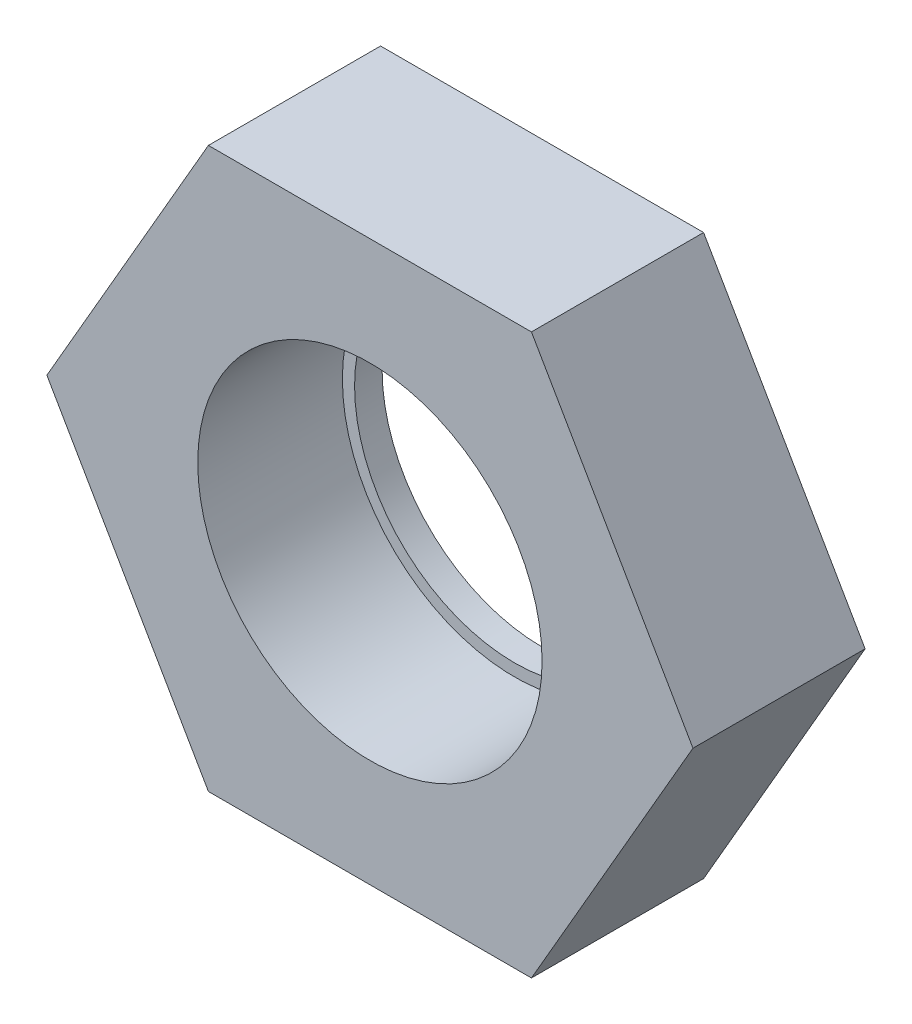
ISO-10303-21;
HEADER;
FILE_DESCRIPTION(('STEP AP214'),'2;1');
FILE_NAME('part.step','',(''),(''),'','','');
FILE_SCHEMA(('AUTOMOTIVE_DESIGN { 1 0 10303 214 1 1 1 1 }'));
ENDSEC;
DATA;
#1=APPLICATION_CONTEXT('core data for automotive mechanical design processes');
#2=APPLICATION_PROTOCOL_DEFINITION('international standard','automotive_design',2000,#1);
#3=PRODUCT_CONTEXT('',#1,'mechanical');
#4=PRODUCT('Part','Part','',(#3));
#5=PRODUCT_RELATED_PRODUCT_CATEGORY('part','',(#4));
#6=PRODUCT_DEFINITION_FORMATION('','',#4);
#7=PRODUCT_DEFINITION_CONTEXT('part definition',#1,'design');
#8=PRODUCT_DEFINITION('design','',#6,#7);
#9=PRODUCT_DEFINITION_SHAPE('','',#8);
#10=(LENGTH_UNIT() NAMED_UNIT(*) SI_UNIT(.MILLI.,.METRE.));
#11=(NAMED_UNIT(*) PLANE_ANGLE_UNIT() SI_UNIT($,.RADIAN.));
#12=(NAMED_UNIT(*) SI_UNIT($,.STERADIAN.) SOLID_ANGLE_UNIT());
#13=UNCERTAINTY_MEASURE_WITH_UNIT(LENGTH_MEASURE(1.E-05),#10,'distance_accuracy_value','');
#14=(GEOMETRIC_REPRESENTATION_CONTEXT(3) GLOBAL_UNCERTAINTY_ASSIGNED_CONTEXT((#13)) GLOBAL_UNIT_ASSIGNED_CONTEXT((#10,
#11,#12)) REPRESENTATION_CONTEXT('',''));
#15=CARTESIAN_POINT('',(0.,0.,0.));
#16=DIRECTION('',(0.,0.,1.));
#17=DIRECTION('',(1.,0.,0.));
#18=AXIS2_PLACEMENT_3D('',#15,#16,#17);
#19=CARTESIAN_POINT('',(17.8725992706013,10.31875,6.35));
#20=DIRECTION('',(0.,0.,1.));
#21=DIRECTION('',(1.,0.,0.));
#22=AXIS2_PLACEMENT_3D('',#19,#20,#21);
#23=PLANE('',#22);
#24=DIRECTION('',(0.5,0.866025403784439,0.));
#25=VECTOR('',#24,1.);
#26=CARTESIAN_POINT('',(5.95753309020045,-10.31875,6.35));
#27=LINE('',#26,#25);
#28=CARTESIAN_POINT('',(5.95753309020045,-10.31875,6.35));
#29=VERTEX_POINT('',#28);
#30=CARTESIAN_POINT('',(11.9150661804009,0.,6.35));
#31=VERTEX_POINT('',#30);
#32=EDGE_CURVE('E100',#29,#31,#27,.T.);
#33=ORIENTED_EDGE('',*,*,#32,.T.);
#34=DIRECTION('',(-0.5,0.866025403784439,0.));
#35=VECTOR('',#34,1.);
#36=CARTESIAN_POINT('',(11.9150661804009,0.,6.35));
#37=LINE('',#36,#35);
#38=CARTESIAN_POINT('',(5.95753309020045,10.31875,6.35));
#39=VERTEX_POINT('',#38);
#40=EDGE_CURVE('E82',#31,#39,#37,.T.);
#41=ORIENTED_EDGE('',*,*,#40,.T.);
#42=DIRECTION('',(-1.,0.,0.));
#43=VECTOR('',#42,1.);
#44=CARTESIAN_POINT('',(5.95753309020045,10.31875,6.35));
#45=LINE('',#44,#43);
#46=CARTESIAN_POINT('',(-5.95753309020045,10.31875,6.35));
#47=VERTEX_POINT('',#46);
#48=EDGE_CURVE('E103',#39,#47,#45,.T.);
#49=ORIENTED_EDGE('',*,*,#48,.T.);
#50=DIRECTION('',(-0.5,-0.866025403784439,0.));
#51=VECTOR('',#50,1.);
#52=CARTESIAN_POINT('',(-5.95753309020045,10.31875,6.35));
#53=LINE('',#52,#51);
#54=CARTESIAN_POINT('',(-11.9150661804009,0.,6.35));
#55=VERTEX_POINT('',#54);
#56=EDGE_CURVE('E105',#47,#55,#53,.T.);
#57=ORIENTED_EDGE('',*,*,#56,.T.);
#58=DIRECTION('',(0.5,-0.866025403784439,0.));
#59=VECTOR('',#58,1.);
#60=CARTESIAN_POINT('',(-11.9150661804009,0.,6.35));
#61=LINE('',#60,#59);
#62=CARTESIAN_POINT('',(-5.95753309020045,-10.31875,6.35));
#63=VERTEX_POINT('',#62);
#64=EDGE_CURVE('E35',#55,#63,#61,.T.);
#65=ORIENTED_EDGE('',*,*,#64,.T.);
#66=DIRECTION('',(1.,0.,0.));
#67=VECTOR('',#66,1.);
#68=CARTESIAN_POINT('',(-5.95753309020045,-10.31875,6.35));
#69=LINE('',#68,#67);
#70=EDGE_CURVE('E30',#63,#29,#69,.T.);
#71=ORIENTED_EDGE('',*,*,#70,.T.);
#72=EDGE_LOOP('',(#33,#41,#49,#57,#65,#71));
#73=FACE_BOUND('',#72,.T.);
#74=CARTESIAN_POINT('',(0.,0.,6.35));
#75=DIRECTION('',(0.,0.,1.));
#76=DIRECTION('',(1.,0.,0.));
#77=AXIS2_PLACEMENT_3D('',#74,#75,#76);
#78=CIRCLE('',#77,6.35);
#79=CARTESIAN_POINT('',(6.35,0.,6.35));
#80=VERTEX_POINT('',#79);
#81=EDGE_CURVE('E18',#80,#80,#78,.F.);
#82=ORIENTED_EDGE('',*,*,#81,.T.);
#83=EDGE_LOOP('',(#82));
#84=FACE_BOUND('',#83,.T.);
#85=ADVANCED_FACE('F14',(#73,#84),#23,.T.);
#86=CARTESIAN_POINT('',(17.8725992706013,10.31875,0.));
#87=DIRECTION('',(0.,0.,1.));
#88=DIRECTION('',(1.,0.,0.));
#89=AXIS2_PLACEMENT_3D('',#86,#87,#88);
#90=PLANE('',#89);
#91=DIRECTION('',(0.5,0.866025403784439,0.));
#92=VECTOR('',#91,1.);
#93=CARTESIAN_POINT('',(5.95753309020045,-10.31875,0.));
#94=LINE('',#93,#92);
#95=CARTESIAN_POINT('',(5.95753309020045,-10.31875,0.));
#96=VERTEX_POINT('',#95);
#97=CARTESIAN_POINT('',(11.9150661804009,0.,0.));
#98=VERTEX_POINT('',#97);
#99=EDGE_CURVE('E73',#96,#98,#94,.T.);
#100=ORIENTED_EDGE('',*,*,#99,.F.);
#101=DIRECTION('',(1.,0.,0.));
#102=VECTOR('',#101,1.);
#103=CARTESIAN_POINT('',(-5.95753309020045,-10.31875,0.));
#104=LINE('',#103,#102);
#105=CARTESIAN_POINT('',(-5.95753309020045,-10.31875,0.));
#106=VERTEX_POINT('',#105);
#107=EDGE_CURVE('E98',#106,#96,#104,.T.);
#108=ORIENTED_EDGE('',*,*,#107,.F.);
#109=DIRECTION('',(0.5,-0.866025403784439,0.));
#110=VECTOR('',#109,1.);
#111=CARTESIAN_POINT('',(-11.9150661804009,0.,0.));
#112=LINE('',#111,#110);
#113=CARTESIAN_POINT('',(-11.9150661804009,0.,0.));
#114=VERTEX_POINT('',#113);
#115=EDGE_CURVE('E96',#114,#106,#112,.T.);
#116=ORIENTED_EDGE('',*,*,#115,.F.);
#117=DIRECTION('',(-0.5,-0.866025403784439,0.));
#118=VECTOR('',#117,1.);
#119=CARTESIAN_POINT('',(-5.95753309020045,10.31875,0.));
#120=LINE('',#119,#118);
#121=CARTESIAN_POINT('',(-5.95753309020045,10.31875,0.));
#122=VERTEX_POINT('',#121);
#123=EDGE_CURVE('E94',#122,#114,#120,.T.);
#124=ORIENTED_EDGE('',*,*,#123,.F.);
#125=DIRECTION('',(-1.,0.,0.));
#126=VECTOR('',#125,1.);
#127=CARTESIAN_POINT('',(5.95753309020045,10.31875,0.));
#128=LINE('',#127,#126);
#129=CARTESIAN_POINT('',(5.95753309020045,10.31875,0.));
#130=VERTEX_POINT('',#129);
#131=EDGE_CURVE('E75',#130,#122,#128,.T.);
#132=ORIENTED_EDGE('',*,*,#131,.F.);
#133=DIRECTION('',(-0.5,0.866025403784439,0.));
#134=VECTOR('',#133,1.);
#135=CARTESIAN_POINT('',(11.9150661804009,0.,0.));
#136=LINE('',#135,#134);
#137=EDGE_CURVE('E68',#98,#130,#136,.T.);
#138=ORIENTED_EDGE('',*,*,#137,.F.);
#139=EDGE_LOOP('',(#100,#108,#116,#124,#132,#138));
#140=FACE_BOUND('',#139,.T.);
#141=CARTESIAN_POINT('',(0.,0.,0.));
#142=DIRECTION('',(0.,0.,1.));
#143=DIRECTION('',(1.,0.,0.));
#144=AXIS2_PLACEMENT_3D('',#141,#142,#143);
#145=CIRCLE('',#144,5.9);
#146=CARTESIAN_POINT('',(5.9,0.,0.));
#147=VERTEX_POINT('',#146);
#148=EDGE_CURVE('E166',#147,#147,#145,.F.);
#149=ORIENTED_EDGE('',*,*,#148,.F.);
#150=EDGE_LOOP('',(#149));
#151=FACE_BOUND('',#150,.T.);
#152=ADVANCED_FACE('F69',(#140,#151),#90,.F.);
#153=CARTESIAN_POINT('',(5.95753309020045,-10.31875,6.35));
#154=DIRECTION('',(-0.866025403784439,0.5,0.));
#155=DIRECTION('',(-0.5,-0.866025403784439,0.));
#156=AXIS2_PLACEMENT_3D('',#153,#154,#155);
#157=PLANE('',#156);
#158=ORIENTED_EDGE('',*,*,#99,.T.);
#159=DIRECTION('',(0.,0.,-1.));
#160=VECTOR('',#159,1.);
#161=CARTESIAN_POINT('',(11.9150661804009,0.,6.35));
#162=LINE('',#161,#160);
#163=EDGE_CURVE('E9',#31,#98,#162,.T.);
#164=ORIENTED_EDGE('',*,*,#163,.F.);
#165=ORIENTED_EDGE('',*,*,#32,.F.);
#166=DIRECTION('',(0.,0.,-1.));
#167=VECTOR('',#166,1.);
#168=CARTESIAN_POINT('',(5.95753309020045,-10.31875,6.35));
#169=LINE('',#168,#167);
#170=EDGE_CURVE('E86',#29,#96,#169,.T.);
#171=ORIENTED_EDGE('',*,*,#170,.T.);
#172=EDGE_LOOP('',(#158,#164,#165,#171));
#173=FACE_BOUND('',#172,.T.);
#174=ADVANCED_FACE('F16',(#173),#157,.F.);
#175=CARTESIAN_POINT('',(11.9150661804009,0.,6.35));
#176=DIRECTION('',(-0.866025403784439,-0.5,0.));
#177=DIRECTION('',(0.5,-0.866025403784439,0.));
#178=AXIS2_PLACEMENT_3D('',#175,#176,#177);
#179=PLANE('',#178);
#180=ORIENTED_EDGE('',*,*,#137,.T.);
#181=DIRECTION('',(0.,0.,-1.));
#182=VECTOR('',#181,1.);
#183=CARTESIAN_POINT('',(5.95753309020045,10.31875,6.35));
#184=LINE('',#183,#182);
#185=EDGE_CURVE('E23',#39,#130,#184,.T.);
#186=ORIENTED_EDGE('',*,*,#185,.F.);
#187=ORIENTED_EDGE('',*,*,#40,.F.);
#188=ORIENTED_EDGE('',*,*,#163,.T.);
#189=EDGE_LOOP('',(#180,#186,#187,#188));
#190=FACE_BOUND('',#189,.T.);
#191=ADVANCED_FACE('F81',(#190),#179,.F.);
#192=CARTESIAN_POINT('',(5.95753309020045,10.31875,6.35));
#193=DIRECTION('',(0.,-1.,0.));
#194=DIRECTION('',(0.,0.,-1.));
#195=AXIS2_PLACEMENT_3D('',#192,#193,#194);
#196=PLANE('',#195);
#197=ORIENTED_EDGE('',*,*,#131,.T.);
#198=DIRECTION('',(0.,0.,-1.));
#199=VECTOR('',#198,1.);
#200=CARTESIAN_POINT('',(-5.95753309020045,10.31875,6.35));
#201=LINE('',#200,#199);
#202=EDGE_CURVE('E116',#47,#122,#201,.T.);
#203=ORIENTED_EDGE('',*,*,#202,.F.);
#204=ORIENTED_EDGE('',*,*,#48,.F.);
#205=ORIENTED_EDGE('',*,*,#185,.T.);
#206=EDGE_LOOP('',(#197,#203,#204,#205));
#207=FACE_BOUND('',#206,.T.);
#208=ADVANCED_FACE('F121',(#207),#196,.F.);
#209=CARTESIAN_POINT('',(-5.95753309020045,10.31875,6.35));
#210=DIRECTION('',(0.866025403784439,-0.5,0.));
#211=DIRECTION('',(0.5,0.866025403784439,0.));
#212=AXIS2_PLACEMENT_3D('',#209,#210,#211);
#213=PLANE('',#212);
#214=ORIENTED_EDGE('',*,*,#123,.T.);
#215=DIRECTION('',(0.,0.,-1.));
#216=VECTOR('',#215,1.);
#217=CARTESIAN_POINT('',(-11.9150661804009,0.,6.35));
#218=LINE('',#217,#216);
#219=EDGE_CURVE('E113',#55,#114,#218,.T.);
#220=ORIENTED_EDGE('',*,*,#219,.F.);
#221=ORIENTED_EDGE('',*,*,#56,.F.);
#222=ORIENTED_EDGE('',*,*,#202,.T.);
#223=EDGE_LOOP('',(#214,#220,#221,#222));
#224=FACE_BOUND('',#223,.T.);
#225=ADVANCED_FACE('F127',(#224),#213,.F.);
#226=CARTESIAN_POINT('',(-11.9150661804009,0.,6.35));
#227=DIRECTION('',(0.866025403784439,0.5,0.));
#228=DIRECTION('',(-0.5,0.866025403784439,0.));
#229=AXIS2_PLACEMENT_3D('',#226,#227,#228);
#230=PLANE('',#229);
#231=ORIENTED_EDGE('',*,*,#115,.T.);
#232=DIRECTION('',(0.,0.,-1.));
#233=VECTOR('',#232,1.);
#234=CARTESIAN_POINT('',(-5.95753309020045,-10.31875,6.35));
#235=LINE('',#234,#233);
#236=EDGE_CURVE('E110',#63,#106,#235,.T.);
#237=ORIENTED_EDGE('',*,*,#236,.F.);
#238=ORIENTED_EDGE('',*,*,#64,.F.);
#239=ORIENTED_EDGE('',*,*,#219,.T.);
#240=EDGE_LOOP('',(#231,#237,#238,#239));
#241=FACE_BOUND('',#240,.T.);
#242=ADVANCED_FACE('F130',(#241),#230,.F.);
#243=CARTESIAN_POINT('',(-5.95753309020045,-10.31875,6.35));
#244=DIRECTION('',(0.,1.,0.));
#245=DIRECTION('',(0.,0.,1.));
#246=AXIS2_PLACEMENT_3D('',#243,#244,#245);
#247=PLANE('',#246);
#248=ORIENTED_EDGE('',*,*,#107,.T.);
#249=ORIENTED_EDGE('',*,*,#170,.F.);
#250=ORIENTED_EDGE('',*,*,#70,.F.);
#251=ORIENTED_EDGE('',*,*,#236,.T.);
#252=EDGE_LOOP('',(#248,#249,#250,#251));
#253=FACE_BOUND('',#252,.T.);
#254=ADVANCED_FACE('F132',(#253),#247,.F.);
#255=CARTESIAN_POINT('',(6.35,0.,1.016));
#256=DIRECTION('',(0.,0.,1.));
#257=DIRECTION('',(1.,0.,0.));
#258=AXIS2_PLACEMENT_3D('',#255,#256,#257);
#259=PLANE('',#258);
#260=CARTESIAN_POINT('',(0.,0.,1.016));
#261=DIRECTION('',(0.,0.,-1.));
#262=DIRECTION('',(-1.,0.,0.));
#263=AXIS2_PLACEMENT_3D('',#260,#261,#262);
#264=CIRCLE('',#263,6.35);
#265=CARTESIAN_POINT('',(-6.35,0.,1.016));
#266=VERTEX_POINT('',#265);
#267=EDGE_CURVE('E89',#266,#266,#264,.T.);
#268=ORIENTED_EDGE('',*,*,#267,.F.);
#269=EDGE_LOOP('',(#268));
#270=FACE_BOUND('',#269,.T.);
#271=CARTESIAN_POINT('',(0.,0.,1.016));
#272=DIRECTION('',(0.,0.,1.));
#273=DIRECTION('',(1.,0.,0.));
#274=AXIS2_PLACEMENT_3D('',#271,#272,#273);
#275=CIRCLE('',#274,5.9);
#276=CARTESIAN_POINT('',(5.9,0.,1.016));
#277=VERTEX_POINT('',#276);
#278=EDGE_CURVE('E169',#277,#277,#275,.T.);
#279=ORIENTED_EDGE('',*,*,#278,.F.);
#280=EDGE_LOOP('',(#279));
#281=FACE_BOUND('',#280,.T.);
#282=ADVANCED_FACE('F134',(#270,#281),#259,.T.);
#283=CARTESIAN_POINT('',(0.,0.,-2.74796771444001));
#284=DIRECTION('',(0.,0.,-1.));
#285=DIRECTION('',(-1.,0.,0.));
#286=AXIS2_PLACEMENT_3D('',#283,#284,#285);
#287=CYLINDRICAL_SURFACE('',#286,6.35);
#288=ORIENTED_EDGE('',*,*,#81,.F.);
#289=EDGE_LOOP('',(#288));
#290=FACE_BOUND('',#289,.T.);
#291=ORIENTED_EDGE('',*,*,#267,.T.);
#292=EDGE_LOOP('',(#291));
#293=FACE_BOUND('',#292,.T.);
#294=ADVANCED_FACE('F142',(#290,#293),#287,.F.);
#295=CARTESIAN_POINT('',(0.,0.,-17.9605122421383));
#296=DIRECTION('',(0.,0.,1.));
#297=DIRECTION('',(1.,0.,0.));
#298=AXIS2_PLACEMENT_3D('',#295,#296,#297);
#299=CYLINDRICAL_SURFACE('',#298,5.9);
#300=ORIENTED_EDGE('',*,*,#148,.T.);
#301=EDGE_LOOP('',(#300));
#302=FACE_BOUND('',#301,.T.);
#303=ORIENTED_EDGE('',*,*,#278,.T.);
#304=EDGE_LOOP('',(#303));
#305=FACE_BOUND('',#304,.T.);
#306=ADVANCED_FACE('F156',(#302,#305),#299,.F.);
#307=CLOSED_SHELL('',(#85,#152,#174,#191,#208,#225,#242,#254,#282,#294,#306));
#308=MANIFOLD_SOLID_BREP('B1',#307);
#309=ADVANCED_BREP_SHAPE_REPRESENTATION('',(#18,#308),#14);
#310=SHAPE_DEFINITION_REPRESENTATION(#9,#309);
ENDSEC;
END-ISO-10303-21;
